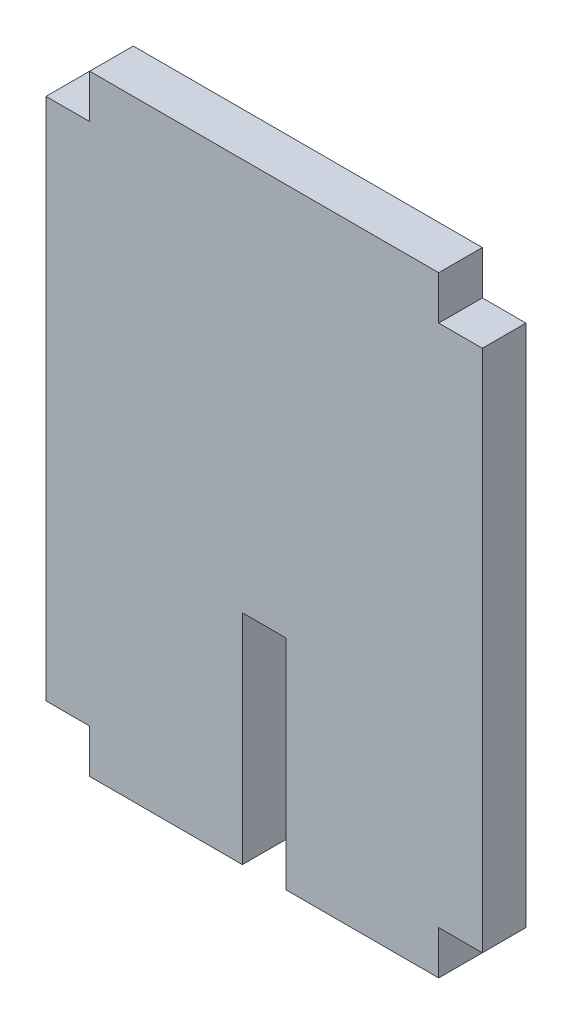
ISO-10303-21;
HEADER;
FILE_DESCRIPTION(('STEP AP214'),'2;1');
FILE_NAME('part.step','',(''),(''),'','','');
FILE_SCHEMA(('AUTOMOTIVE_DESIGN { 1 0 10303 214 1 1 1 1 }'));
ENDSEC;
DATA;
#1=APPLICATION_CONTEXT('core data for automotive mechanical design processes');
#2=APPLICATION_PROTOCOL_DEFINITION('international standard','automotive_design',2000,#1);
#3=PRODUCT_CONTEXT('',#1,'mechanical');
#4=PRODUCT('Part','Part','',(#3));
#5=PRODUCT_RELATED_PRODUCT_CATEGORY('part','',(#4));
#6=PRODUCT_DEFINITION_FORMATION('','',#4);
#7=PRODUCT_DEFINITION_CONTEXT('part definition',#1,'design');
#8=PRODUCT_DEFINITION('design','',#6,#7);
#9=PRODUCT_DEFINITION_SHAPE('','',#8);
#10=(LENGTH_UNIT() NAMED_UNIT(*) SI_UNIT(.MILLI.,.METRE.));
#11=(NAMED_UNIT(*) PLANE_ANGLE_UNIT() SI_UNIT($,.RADIAN.));
#12=(NAMED_UNIT(*) SI_UNIT($,.STERADIAN.) SOLID_ANGLE_UNIT());
#13=UNCERTAINTY_MEASURE_WITH_UNIT(LENGTH_MEASURE(1.E-05),#10,'distance_accuracy_value','');
#14=(GEOMETRIC_REPRESENTATION_CONTEXT(3) GLOBAL_UNCERTAINTY_ASSIGNED_CONTEXT((#13)) GLOBAL_UNIT_ASSIGNED_CONTEXT((#10,
#11,#12)) REPRESENTATION_CONTEXT('',''));
#15=CARTESIAN_POINT('',(0.,0.,0.));
#16=DIRECTION('',(0.,0.,1.));
#17=DIRECTION('',(1.,0.,0.));
#18=AXIS2_PLACEMENT_3D('',#15,#16,#17);
#19=CARTESIAN_POINT('',(-15.875,-22.225,3.175));
#20=DIRECTION('',(0.,1.,0.));
#21=DIRECTION('',(0.,0.,1.));
#22=AXIS2_PLACEMENT_3D('',#19,#20,#21);
#23=PLANE('',#22);
#24=DIRECTION('',(1.,0.,0.));
#25=VECTOR('',#24,1.);
#26=CARTESIAN_POINT('',(-15.875,-22.225,0.));
#27=LINE('',#26,#25);
#28=CARTESIAN_POINT('',(-12.7,-22.225,0.));
#29=VERTEX_POINT('',#28);
#30=CARTESIAN_POINT('',(-1.5875,-22.225,0.));
#31=VERTEX_POINT('',#30);
#32=EDGE_CURVE('E35',#29,#31,#27,.T.);
#33=ORIENTED_EDGE('',*,*,#32,.T.);
#34=DIRECTION('',(0.,0.,1.));
#35=VECTOR('',#34,1.);
#36=CARTESIAN_POINT('',(-1.5875,-22.225,0.));
#37=LINE('',#36,#35);
#38=CARTESIAN_POINT('',(-1.5875,-22.225,3.175));
#39=VERTEX_POINT('',#38);
#40=EDGE_CURVE('E146',#31,#39,#37,.T.);
#41=ORIENTED_EDGE('',*,*,#40,.T.);
#42=DIRECTION('',(1.,0.,0.));
#43=VECTOR('',#42,1.);
#44=CARTESIAN_POINT('',(-15.875,-22.225,3.175));
#45=LINE('',#44,#43);
#46=CARTESIAN_POINT('',(-12.7,-22.225,3.175));
#47=VERTEX_POINT('',#46);
#48=EDGE_CURVE('E11',#47,#39,#45,.T.);
#49=ORIENTED_EDGE('',*,*,#48,.F.);
#50=DIRECTION('',(0.,0.,1.));
#51=VECTOR('',#50,1.);
#52=CARTESIAN_POINT('',(-12.7,-22.225,0.));
#53=LINE('',#52,#51);
#54=EDGE_CURVE('E166',#29,#47,#53,.T.);
#55=ORIENTED_EDGE('',*,*,#54,.F.);
#56=EDGE_LOOP('',(#33,#41,#49,#55));
#57=FACE_BOUND('',#56,.T.);
#58=ADVANCED_FACE('F31',(#57),#23,.F.);
#59=CARTESIAN_POINT('',(15.875,22.225,3.175));
#60=DIRECTION('',(-1.,0.,0.));
#61=DIRECTION('',(0.,-1.,0.));
#62=AXIS2_PLACEMENT_3D('',#59,#60,#61);
#63=PLANE('',#62);
#64=DIRECTION('',(0.,1.,0.));
#65=VECTOR('',#64,1.);
#66=CARTESIAN_POINT('',(15.875,22.225,3.175));
#67=LINE('',#66,#65);
#68=CARTESIAN_POINT('',(15.875,-19.05,3.175));
#69=VERTEX_POINT('',#68);
#70=CARTESIAN_POINT('',(15.875,19.05,3.175));
#71=VERTEX_POINT('',#70);
#72=EDGE_CURVE('E167',#69,#71,#67,.T.);
#73=ORIENTED_EDGE('',*,*,#72,.F.);
#74=DIRECTION('',(0.,0.,1.));
#75=VECTOR('',#74,1.);
#76=CARTESIAN_POINT('',(15.875,-19.05,0.));
#77=LINE('',#76,#75);
#78=CARTESIAN_POINT('',(15.875,-19.05,0.));
#79=VERTEX_POINT('',#78);
#80=EDGE_CURVE('E230',#79,#69,#77,.T.);
#81=ORIENTED_EDGE('',*,*,#80,.F.);
#82=DIRECTION('',(0.,1.,0.));
#83=VECTOR('',#82,1.);
#84=CARTESIAN_POINT('',(15.875,22.225,0.));
#85=LINE('',#84,#83);
#86=CARTESIAN_POINT('',(15.875,19.05,0.));
#87=VERTEX_POINT('',#86);
#88=EDGE_CURVE('E183',#79,#87,#85,.T.);
#89=ORIENTED_EDGE('',*,*,#88,.T.);
#90=DIRECTION('',(0.,0.,1.));
#91=VECTOR('',#90,1.);
#92=CARTESIAN_POINT('',(15.875,19.05,0.));
#93=LINE('',#92,#91);
#94=EDGE_CURVE('E206',#87,#71,#93,.T.);
#95=ORIENTED_EDGE('',*,*,#94,.T.);
#96=EDGE_LOOP('',(#73,#81,#89,#95));
#97=FACE_BOUND('',#96,.T.);
#98=ADVANCED_FACE('F33',(#97),#63,.F.);
#99=CARTESIAN_POINT('',(-15.875,22.225,3.175));
#100=DIRECTION('',(0.,-1.,0.));
#101=DIRECTION('',(0.,0.,-1.));
#102=AXIS2_PLACEMENT_3D('',#99,#100,#101);
#103=PLANE('',#102);
#104=DIRECTION('',(-1.,0.,0.));
#105=VECTOR('',#104,1.);
#106=CARTESIAN_POINT('',(-15.875,22.225,3.175));
#107=LINE('',#106,#105);
#108=CARTESIAN_POINT('',(12.7,22.225,3.175));
#109=VERTEX_POINT('',#108);
#110=CARTESIAN_POINT('',(-12.7,22.225,3.175));
#111=VERTEX_POINT('',#110);
#112=EDGE_CURVE('E169',#109,#111,#107,.T.);
#113=ORIENTED_EDGE('',*,*,#112,.F.);
#114=DIRECTION('',(0.,0.,1.));
#115=VECTOR('',#114,1.);
#116=CARTESIAN_POINT('',(12.7,22.225,0.));
#117=LINE('',#116,#115);
#118=CARTESIAN_POINT('',(12.7,22.225,0.));
#119=VERTEX_POINT('',#118);
#120=EDGE_CURVE('E211',#119,#109,#117,.T.);
#121=ORIENTED_EDGE('',*,*,#120,.F.);
#122=DIRECTION('',(-1.,0.,0.));
#123=VECTOR('',#122,1.);
#124=CARTESIAN_POINT('',(-15.875,22.225,0.));
#125=LINE('',#124,#123);
#126=CARTESIAN_POINT('',(-12.7,22.225,0.));
#127=VERTEX_POINT('',#126);
#128=EDGE_CURVE('E178',#119,#127,#125,.T.);
#129=ORIENTED_EDGE('',*,*,#128,.T.);
#130=DIRECTION('',(0.,0.,1.));
#131=VECTOR('',#130,1.);
#132=CARTESIAN_POINT('',(-12.7,22.225,0.));
#133=LINE('',#132,#131);
#134=EDGE_CURVE('E186',#127,#111,#133,.T.);
#135=ORIENTED_EDGE('',*,*,#134,.T.);
#136=EDGE_LOOP('',(#113,#121,#129,#135));
#137=FACE_BOUND('',#136,.T.);
#138=ADVANCED_FACE('F303',(#137),#103,.F.);
#139=CARTESIAN_POINT('',(-15.875,22.225,3.175));
#140=DIRECTION('',(1.,0.,0.));
#141=DIRECTION('',(0.,1.,0.));
#142=AXIS2_PLACEMENT_3D('',#139,#140,#141);
#143=PLANE('',#142);
#144=DIRECTION('',(0.,-1.,0.));
#145=VECTOR('',#144,1.);
#146=CARTESIAN_POINT('',(-15.875,22.225,0.));
#147=LINE('',#146,#145);
#148=CARTESIAN_POINT('',(-15.875,19.05,0.));
#149=VERTEX_POINT('',#148);
#150=CARTESIAN_POINT('',(-15.875,-19.05,0.));
#151=VERTEX_POINT('',#150);
#152=EDGE_CURVE('E171',#149,#151,#147,.T.);
#153=ORIENTED_EDGE('',*,*,#152,.T.);
#154=DIRECTION('',(0.,0.,1.));
#155=VECTOR('',#154,1.);
#156=CARTESIAN_POINT('',(-15.875,-19.05,0.));
#157=LINE('',#156,#155);
#158=CARTESIAN_POINT('',(-15.875,-19.05,3.175));
#159=VERTEX_POINT('',#158);
#160=EDGE_CURVE('E243',#151,#159,#157,.T.);
#161=ORIENTED_EDGE('',*,*,#160,.T.);
#162=DIRECTION('',(0.,-1.,0.));
#163=VECTOR('',#162,1.);
#164=CARTESIAN_POINT('',(-15.875,22.225,3.175));
#165=LINE('',#164,#163);
#166=CARTESIAN_POINT('',(-15.875,19.05,3.175));
#167=VERTEX_POINT('',#166);
#168=EDGE_CURVE('E188',#167,#159,#165,.T.);
#169=ORIENTED_EDGE('',*,*,#168,.F.);
#170=DIRECTION('',(0.,0.,1.));
#171=VECTOR('',#170,1.);
#172=CARTESIAN_POINT('',(-15.875,19.05,0.));
#173=LINE('',#172,#171);
#174=EDGE_CURVE('E192',#149,#167,#173,.T.);
#175=ORIENTED_EDGE('',*,*,#174,.F.);
#176=EDGE_LOOP('',(#153,#161,#169,#175));
#177=FACE_BOUND('',#176,.T.);
#178=ADVANCED_FACE('F314',(#177),#143,.F.);
#179=CARTESIAN_POINT('',(1.5875,-22.225,3.175));
#180=VERTEX_POINT('',#179);
#181=CARTESIAN_POINT('',(12.7,-22.225,3.175));
#182=VERTEX_POINT('',#181);
#183=EDGE_CURVE('E40',#180,#182,#45,.T.);
#184=ORIENTED_EDGE('',*,*,#183,.F.);
#185=DIRECTION('',(0.,0.,1.));
#186=VECTOR('',#185,1.);
#187=CARTESIAN_POINT('',(1.5875,-22.225,0.));
#188=LINE('',#187,#186);
#189=CARTESIAN_POINT('',(1.5875,-22.225,0.));
#190=VERTEX_POINT('',#189);
#191=EDGE_CURVE('E155',#190,#180,#188,.T.);
#192=ORIENTED_EDGE('',*,*,#191,.F.);
#193=CARTESIAN_POINT('',(12.7,-22.225,0.));
#194=VERTEX_POINT('',#193);
#195=EDGE_CURVE('E168',#190,#194,#27,.T.);
#196=ORIENTED_EDGE('',*,*,#195,.T.);
#197=DIRECTION('',(0.,0.,1.));
#198=VECTOR('',#197,1.);
#199=CARTESIAN_POINT('',(12.7,-22.225,0.));
#200=LINE('',#199,#198);
#201=EDGE_CURVE('E225',#194,#182,#200,.T.);
#202=ORIENTED_EDGE('',*,*,#201,.T.);
#203=EDGE_LOOP('',(#184,#192,#196,#202));
#204=FACE_BOUND('',#203,.T.);
#205=ADVANCED_FACE('F276',(#204),#23,.F.);
#206=CARTESIAN_POINT('',(15.875,-22.225,3.175));
#207=DIRECTION('',(0.,0.,1.));
#208=DIRECTION('',(1.,0.,0.));
#209=AXIS2_PLACEMENT_3D('',#206,#207,#208);
#210=PLANE('',#209);
#211=DIRECTION('',(0.,-1.,0.));
#212=VECTOR('',#211,1.);
#213=CARTESIAN_POINT('',(-1.5875,-22.225,3.175));
#214=LINE('',#213,#212);
#215=CARTESIAN_POINT('',(-1.5875,-6.34999999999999,3.175));
#216=VERTEX_POINT('',#215);
#217=EDGE_CURVE('E151',#216,#39,#214,.T.);
#218=ORIENTED_EDGE('',*,*,#217,.F.);
#219=DIRECTION('',(-1.,0.,0.));
#220=VECTOR('',#219,1.);
#221=CARTESIAN_POINT('',(-1.5875,-6.34999999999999,3.175));
#222=LINE('',#221,#220);
#223=CARTESIAN_POINT('',(1.5875,-6.34999999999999,3.175));
#224=VERTEX_POINT('',#223);
#225=EDGE_CURVE('E163',#224,#216,#222,.T.);
#226=ORIENTED_EDGE('',*,*,#225,.F.);
#227=DIRECTION('',(0.,1.,0.));
#228=VECTOR('',#227,1.);
#229=CARTESIAN_POINT('',(1.5875,-22.225,3.175));
#230=LINE('',#229,#228);
#231=EDGE_CURVE('E267',#180,#224,#230,.T.);
#232=ORIENTED_EDGE('',*,*,#231,.F.);
#233=ORIENTED_EDGE('',*,*,#183,.T.);
#234=DIRECTION('',(0.,-1.,0.));
#235=VECTOR('',#234,1.);
#236=CARTESIAN_POINT('',(12.7,-22.225,3.175));
#237=LINE('',#236,#235);
#238=CARTESIAN_POINT('',(12.7,-19.05,3.175));
#239=VERTEX_POINT('',#238);
#240=EDGE_CURVE('E236',#239,#182,#237,.T.);
#241=ORIENTED_EDGE('',*,*,#240,.F.);
#242=DIRECTION('',(-1.,0.,0.));
#243=VECTOR('',#242,1.);
#244=CARTESIAN_POINT('',(15.875,-19.05,3.175));
#245=LINE('',#244,#243);
#246=EDGE_CURVE('E240',#69,#239,#245,.T.);
#247=ORIENTED_EDGE('',*,*,#246,.F.);
#248=ORIENTED_EDGE('',*,*,#72,.T.);
#249=DIRECTION('',(1.,0.,0.));
#250=VECTOR('',#249,1.);
#251=CARTESIAN_POINT('',(15.875,19.05,3.175));
#252=LINE('',#251,#250);
#253=CARTESIAN_POINT('',(12.7,19.05,3.175));
#254=VERTEX_POINT('',#253);
#255=EDGE_CURVE('E218',#254,#71,#252,.T.);
#256=ORIENTED_EDGE('',*,*,#255,.F.);
#257=DIRECTION('',(0.,-1.,0.));
#258=VECTOR('',#257,1.);
#259=CARTESIAN_POINT('',(12.7,22.225,3.175));
#260=LINE('',#259,#258);
#261=EDGE_CURVE('E222',#109,#254,#260,.T.);
#262=ORIENTED_EDGE('',*,*,#261,.F.);
#263=ORIENTED_EDGE('',*,*,#112,.T.);
#264=DIRECTION('',(0.,1.,0.));
#265=VECTOR('',#264,1.);
#266=CARTESIAN_POINT('',(-12.7,22.225,3.175));
#267=LINE('',#266,#265);
#268=CARTESIAN_POINT('',(-12.7,19.05,3.175));
#269=VERTEX_POINT('',#268);
#270=EDGE_CURVE('E199',#269,#111,#267,.T.);
#271=ORIENTED_EDGE('',*,*,#270,.F.);
#272=DIRECTION('',(1.,0.,0.));
#273=VECTOR('',#272,1.);
#274=CARTESIAN_POINT('',(-15.875,19.05,3.175));
#275=LINE('',#274,#273);
#276=EDGE_CURVE('E203',#167,#269,#275,.T.);
#277=ORIENTED_EDGE('',*,*,#276,.F.);
#278=ORIENTED_EDGE('',*,*,#168,.T.);
#279=DIRECTION('',(-1.,0.,0.));
#280=VECTOR('',#279,1.);
#281=CARTESIAN_POINT('',(-15.875,-19.05,3.175));
#282=LINE('',#281,#280);
#283=CARTESIAN_POINT('',(-12.7,-19.05,3.175));
#284=VERTEX_POINT('',#283);
#285=EDGE_CURVE('E252',#284,#159,#282,.T.);
#286=ORIENTED_EDGE('',*,*,#285,.F.);
#287=DIRECTION('',(0.,1.,0.));
#288=VECTOR('',#287,1.);
#289=CARTESIAN_POINT('',(-12.7,-22.225,3.175));
#290=LINE('',#289,#288);
#291=EDGE_CURVE('E255',#47,#284,#290,.T.);
#292=ORIENTED_EDGE('',*,*,#291,.F.);
#293=ORIENTED_EDGE('',*,*,#48,.T.);
#294=EDGE_LOOP('',(#218,#226,#232,#233,#241,#247,#248,#256,#262,#263,#271,#277,#278,#286,#292,#293));
#295=FACE_BOUND('',#294,.T.);
#296=ADVANCED_FACE('F279',(#295),#210,.T.);
#297=CARTESIAN_POINT('',(15.875,-22.225,0.));
#298=DIRECTION('',(0.,0.,1.));
#299=DIRECTION('',(1.,0.,0.));
#300=AXIS2_PLACEMENT_3D('',#297,#298,#299);
#301=PLANE('',#300);
#302=DIRECTION('',(-1.,0.,0.));
#303=VECTOR('',#302,1.);
#304=CARTESIAN_POINT('',(-1.5875,-6.34999999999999,0.));
#305=LINE('',#304,#303);
#306=CARTESIAN_POINT('',(1.5875,-6.34999999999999,0.));
#307=VERTEX_POINT('',#306);
#308=CARTESIAN_POINT('',(-1.5875,-6.34999999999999,0.));
#309=VERTEX_POINT('',#308);
#310=EDGE_CURVE('E48',#307,#309,#305,.T.);
#311=ORIENTED_EDGE('',*,*,#310,.T.);
#312=DIRECTION('',(0.,-1.,0.));
#313=VECTOR('',#312,1.);
#314=CARTESIAN_POINT('',(-1.5875,-22.225,0.));
#315=LINE('',#314,#313);
#316=EDGE_CURVE('E149',#309,#31,#315,.T.);
#317=ORIENTED_EDGE('',*,*,#316,.T.);
#318=ORIENTED_EDGE('',*,*,#32,.F.);
#319=DIRECTION('',(0.,1.,0.));
#320=VECTOR('',#319,1.);
#321=CARTESIAN_POINT('',(-12.7,-22.225,0.));
#322=LINE('',#321,#320);
#323=CARTESIAN_POINT('',(-12.7,-19.05,0.));
#324=VERTEX_POINT('',#323);
#325=EDGE_CURVE('E254',#29,#324,#322,.T.);
#326=ORIENTED_EDGE('',*,*,#325,.T.);
#327=DIRECTION('',(-1.,0.,0.));
#328=VECTOR('',#327,1.);
#329=CARTESIAN_POINT('',(-15.875,-19.05,0.));
#330=LINE('',#329,#328);
#331=EDGE_CURVE('E56',#324,#151,#330,.T.);
#332=ORIENTED_EDGE('',*,*,#331,.T.);
#333=ORIENTED_EDGE('',*,*,#152,.F.);
#334=DIRECTION('',(1.,0.,0.));
#335=VECTOR('',#334,1.);
#336=CARTESIAN_POINT('',(-15.875,19.05,0.));
#337=LINE('',#336,#335);
#338=CARTESIAN_POINT('',(-12.7,19.05,0.));
#339=VERTEX_POINT('',#338);
#340=EDGE_CURVE('E202',#149,#339,#337,.T.);
#341=ORIENTED_EDGE('',*,*,#340,.T.);
#342=DIRECTION('',(0.,1.,0.));
#343=VECTOR('',#342,1.);
#344=CARTESIAN_POINT('',(-12.7,22.225,0.));
#345=LINE('',#344,#343);
#346=EDGE_CURVE('E195',#339,#127,#345,.T.);
#347=ORIENTED_EDGE('',*,*,#346,.T.);
#348=ORIENTED_EDGE('',*,*,#128,.F.);
#349=DIRECTION('',(0.,-1.,0.));
#350=VECTOR('',#349,1.);
#351=CARTESIAN_POINT('',(12.7,22.225,0.));
#352=LINE('',#351,#350);
#353=CARTESIAN_POINT('',(12.7,19.05,0.));
#354=VERTEX_POINT('',#353);
#355=EDGE_CURVE('E221',#119,#354,#352,.T.);
#356=ORIENTED_EDGE('',*,*,#355,.T.);
#357=DIRECTION('',(1.,0.,0.));
#358=VECTOR('',#357,1.);
#359=CARTESIAN_POINT('',(15.875,19.05,0.));
#360=LINE('',#359,#358);
#361=EDGE_CURVE('E214',#354,#87,#360,.T.);
#362=ORIENTED_EDGE('',*,*,#361,.T.);
#363=ORIENTED_EDGE('',*,*,#88,.F.);
#364=DIRECTION('',(-1.,0.,0.));
#365=VECTOR('',#364,1.);
#366=CARTESIAN_POINT('',(15.875,-19.05,0.));
#367=LINE('',#366,#365);
#368=CARTESIAN_POINT('',(12.7,-19.05,0.));
#369=VERTEX_POINT('',#368);
#370=EDGE_CURVE('E239',#79,#369,#367,.T.);
#371=ORIENTED_EDGE('',*,*,#370,.T.);
#372=DIRECTION('',(0.,-1.,0.));
#373=VECTOR('',#372,1.);
#374=CARTESIAN_POINT('',(12.7,-22.225,0.));
#375=LINE('',#374,#373);
#376=EDGE_CURVE('E233',#369,#194,#375,.T.);
#377=ORIENTED_EDGE('',*,*,#376,.T.);
#378=ORIENTED_EDGE('',*,*,#195,.F.);
#379=DIRECTION('',(0.,1.,0.));
#380=VECTOR('',#379,1.);
#381=CARTESIAN_POINT('',(1.5875,-22.225,0.));
#382=LINE('',#381,#380);
#383=EDGE_CURVE('E162',#190,#307,#382,.T.);
#384=ORIENTED_EDGE('',*,*,#383,.T.);
#385=EDGE_LOOP('',(#311,#317,#318,#326,#332,#333,#341,#347,#348,#356,#362,#363,#371,#377,#378,#384));
#386=FACE_BOUND('',#385,.T.);
#387=ADVANCED_FACE('F159',(#386),#301,.F.);
#388=CARTESIAN_POINT('',(-12.7,22.225,0.));
#389=DIRECTION('',(1.,0.,0.));
#390=DIRECTION('',(0.,0.,-1.));
#391=AXIS2_PLACEMENT_3D('',#388,#389,#390);
#392=PLANE('',#391);
#393=ORIENTED_EDGE('',*,*,#270,.T.);
#394=ORIENTED_EDGE('',*,*,#134,.F.);
#395=ORIENTED_EDGE('',*,*,#346,.F.);
#396=DIRECTION('',(0.,0.,1.));
#397=VECTOR('',#396,1.);
#398=CARTESIAN_POINT('',(-12.7,19.05,0.));
#399=LINE('',#398,#397);
#400=EDGE_CURVE('E194',#339,#269,#399,.T.);
#401=ORIENTED_EDGE('',*,*,#400,.T.);
#402=EDGE_LOOP('',(#393,#394,#395,#401));
#403=FACE_BOUND('',#402,.T.);
#404=ADVANCED_FACE('F308',(#403),#392,.F.);
#405=CARTESIAN_POINT('',(-15.875,19.05,0.));
#406=DIRECTION('',(0.,-1.,0.));
#407=DIRECTION('',(0.,0.,-1.));
#408=AXIS2_PLACEMENT_3D('',#405,#406,#407);
#409=PLANE('',#408);
#410=ORIENTED_EDGE('',*,*,#276,.T.);
#411=ORIENTED_EDGE('',*,*,#400,.F.);
#412=ORIENTED_EDGE('',*,*,#340,.F.);
#413=ORIENTED_EDGE('',*,*,#174,.T.);
#414=EDGE_LOOP('',(#410,#411,#412,#413));
#415=FACE_BOUND('',#414,.T.);
#416=ADVANCED_FACE('F311',(#415),#409,.F.);
#417=CARTESIAN_POINT('',(15.875,19.05,0.));
#418=DIRECTION('',(0.,-1.,0.));
#419=DIRECTION('',(0.,0.,-1.));
#420=AXIS2_PLACEMENT_3D('',#417,#418,#419);
#421=PLANE('',#420);
#422=ORIENTED_EDGE('',*,*,#255,.T.);
#423=ORIENTED_EDGE('',*,*,#94,.F.);
#424=ORIENTED_EDGE('',*,*,#361,.F.);
#425=DIRECTION('',(0.,0.,1.));
#426=VECTOR('',#425,1.);
#427=CARTESIAN_POINT('',(12.7,19.05,0.));
#428=LINE('',#427,#426);
#429=EDGE_CURVE('E213',#354,#254,#428,.T.);
#430=ORIENTED_EDGE('',*,*,#429,.T.);
#431=EDGE_LOOP('',(#422,#423,#424,#430));
#432=FACE_BOUND('',#431,.T.);
#433=ADVANCED_FACE('F294',(#432),#421,.F.);
#434=CARTESIAN_POINT('',(12.7,22.225,0.));
#435=DIRECTION('',(-1.,0.,0.));
#436=DIRECTION('',(0.,0.,1.));
#437=AXIS2_PLACEMENT_3D('',#434,#435,#436);
#438=PLANE('',#437);
#439=ORIENTED_EDGE('',*,*,#261,.T.);
#440=ORIENTED_EDGE('',*,*,#429,.F.);
#441=ORIENTED_EDGE('',*,*,#355,.F.);
#442=ORIENTED_EDGE('',*,*,#120,.T.);
#443=EDGE_LOOP('',(#439,#440,#441,#442));
#444=FACE_BOUND('',#443,.T.);
#445=ADVANCED_FACE('F299',(#444),#438,.F.);
#446=CARTESIAN_POINT('',(12.7,-22.225,0.));
#447=DIRECTION('',(-1.,0.,0.));
#448=DIRECTION('',(0.,0.,1.));
#449=AXIS2_PLACEMENT_3D('',#446,#447,#448);
#450=PLANE('',#449);
#451=ORIENTED_EDGE('',*,*,#240,.T.);
#452=ORIENTED_EDGE('',*,*,#201,.F.);
#453=ORIENTED_EDGE('',*,*,#376,.F.);
#454=DIRECTION('',(0.,0.,1.));
#455=VECTOR('',#454,1.);
#456=CARTESIAN_POINT('',(12.7,-19.05,0.));
#457=LINE('',#456,#455);
#458=EDGE_CURVE('E232',#369,#239,#457,.T.);
#459=ORIENTED_EDGE('',*,*,#458,.T.);
#460=EDGE_LOOP('',(#451,#452,#453,#459));
#461=FACE_BOUND('',#460,.T.);
#462=ADVANCED_FACE('F283',(#461),#450,.F.);
#463=CARTESIAN_POINT('',(15.875,-19.05,0.));
#464=DIRECTION('',(0.,1.,0.));
#465=DIRECTION('',(0.,0.,1.));
#466=AXIS2_PLACEMENT_3D('',#463,#464,#465);
#467=PLANE('',#466);
#468=ORIENTED_EDGE('',*,*,#246,.T.);
#469=ORIENTED_EDGE('',*,*,#458,.F.);
#470=ORIENTED_EDGE('',*,*,#370,.F.);
#471=ORIENTED_EDGE('',*,*,#80,.T.);
#472=EDGE_LOOP('',(#468,#469,#470,#471));
#473=FACE_BOUND('',#472,.T.);
#474=ADVANCED_FACE('F286',(#473),#467,.F.);
#475=CARTESIAN_POINT('',(-15.875,-19.05,0.));
#476=DIRECTION('',(0.,1.,0.));
#477=DIRECTION('',(0.,0.,1.));
#478=AXIS2_PLACEMENT_3D('',#475,#476,#477);
#479=PLANE('',#478);
#480=ORIENTED_EDGE('',*,*,#285,.T.);
#481=ORIENTED_EDGE('',*,*,#160,.F.);
#482=ORIENTED_EDGE('',*,*,#331,.F.);
#483=DIRECTION('',(0.,0.,1.));
#484=VECTOR('',#483,1.);
#485=CARTESIAN_POINT('',(-12.7,-19.05,0.));
#486=LINE('',#485,#484);
#487=EDGE_CURVE('E249',#324,#284,#486,.T.);
#488=ORIENTED_EDGE('',*,*,#487,.T.);
#489=EDGE_LOOP('',(#480,#481,#482,#488));
#490=FACE_BOUND('',#489,.T.);
#491=ADVANCED_FACE('F315',(#490),#479,.F.);
#492=CARTESIAN_POINT('',(-12.7,-22.225,0.));
#493=DIRECTION('',(1.,0.,0.));
#494=DIRECTION('',(0.,0.,-1.));
#495=AXIS2_PLACEMENT_3D('',#492,#493,#494);
#496=PLANE('',#495);
#497=ORIENTED_EDGE('',*,*,#291,.T.);
#498=ORIENTED_EDGE('',*,*,#487,.F.);
#499=ORIENTED_EDGE('',*,*,#325,.F.);
#500=ORIENTED_EDGE('',*,*,#54,.T.);
#501=EDGE_LOOP('',(#497,#498,#499,#500));
#502=FACE_BOUND('',#501,.T.);
#503=ADVANCED_FACE('F317',(#502),#496,.F.);
#504=CARTESIAN_POINT('',(-1.5875,-22.225,0.));
#505=DIRECTION('',(-1.,0.,0.));
#506=DIRECTION('',(0.,-1.,0.));
#507=AXIS2_PLACEMENT_3D('',#504,#505,#506);
#508=PLANE('',#507);
#509=ORIENTED_EDGE('',*,*,#217,.T.);
#510=ORIENTED_EDGE('',*,*,#40,.F.);
#511=ORIENTED_EDGE('',*,*,#316,.F.);
#512=DIRECTION('',(0.,0.,1.));
#513=VECTOR('',#512,1.);
#514=CARTESIAN_POINT('',(-1.5875,-6.34999999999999,0.));
#515=LINE('',#514,#513);
#516=EDGE_CURVE('E258',#309,#216,#515,.T.);
#517=ORIENTED_EDGE('',*,*,#516,.T.);
#518=EDGE_LOOP('',(#509,#510,#511,#517));
#519=FACE_BOUND('',#518,.T.);
#520=ADVANCED_FACE('F148',(#519),#508,.F.);
#521=CARTESIAN_POINT('',(-1.5875,-6.34999999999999,0.));
#522=DIRECTION('',(0.,1.,0.));
#523=DIRECTION('',(0.,0.,1.));
#524=AXIS2_PLACEMENT_3D('',#521,#522,#523);
#525=PLANE('',#524);
#526=ORIENTED_EDGE('',*,*,#225,.T.);
#527=ORIENTED_EDGE('',*,*,#516,.F.);
#528=ORIENTED_EDGE('',*,*,#310,.F.);
#529=DIRECTION('',(0.,0.,1.));
#530=VECTOR('',#529,1.);
#531=CARTESIAN_POINT('',(1.5875,-6.34999999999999,0.));
#532=LINE('',#531,#530);
#533=EDGE_CURVE('E262',#307,#224,#532,.T.);
#534=ORIENTED_EDGE('',*,*,#533,.T.);
#535=EDGE_LOOP('',(#526,#527,#528,#534));
#536=FACE_BOUND('',#535,.T.);
#537=ADVANCED_FACE('F319',(#536),#525,.F.);
#538=CARTESIAN_POINT('',(1.5875,-22.225,0.));
#539=DIRECTION('',(1.,0.,0.));
#540=DIRECTION('',(0.,0.,-1.));
#541=AXIS2_PLACEMENT_3D('',#538,#539,#540);
#542=PLANE('',#541);
#543=ORIENTED_EDGE('',*,*,#231,.T.);
#544=ORIENTED_EDGE('',*,*,#533,.F.);
#545=ORIENTED_EDGE('',*,*,#383,.F.);
#546=ORIENTED_EDGE('',*,*,#191,.T.);
#547=EDGE_LOOP('',(#543,#544,#545,#546));
#548=FACE_BOUND('',#547,.T.);
#549=ADVANCED_FACE('F273',(#548),#542,.F.);
#550=CLOSED_SHELL('',(#58,#98,#138,#178,#205,#296,#387,#404,#416,#433,#445,#462,#474,#491,#503,
#520,#537,#549));
#551=MANIFOLD_SOLID_BREP('B2',#550);
#552=ADVANCED_BREP_SHAPE_REPRESENTATION('',(#18,#551),#14);
#553=SHAPE_DEFINITION_REPRESENTATION(#9,#552);
ENDSEC;
END-ISO-10303-21;
